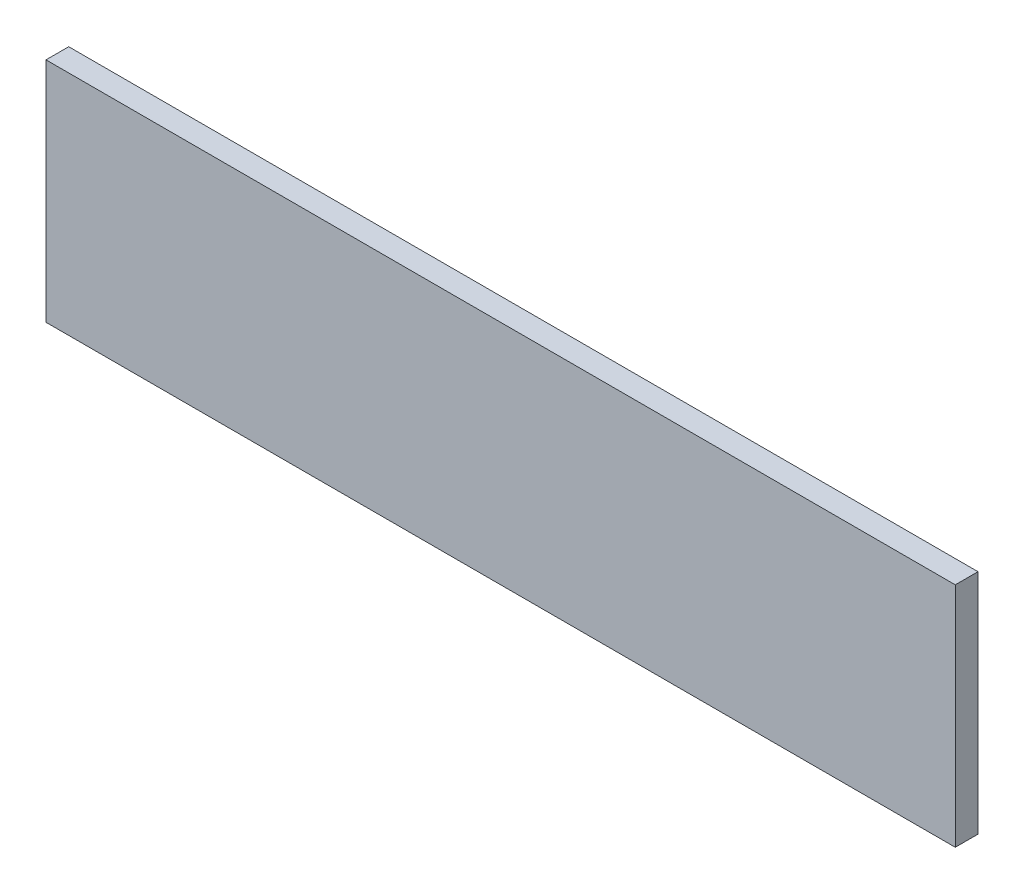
from build123d import *

# Parameters (mm, degrees)
SKETCH_1_W      = 240
SKETCH_1_H      = 60
EXTRUDE_1_DEPTH = 3


with BuildPart() as part:
    # Sketch 1 → Extrude 1 (new, symmetric)
    with BuildSketch(Plane.XY):
        Rectangle(SKETCH_1_W, SKETCH_1_H)
    extrude(amount=EXTRUDE_1_DEPTH, both=True)


solid = part.part
